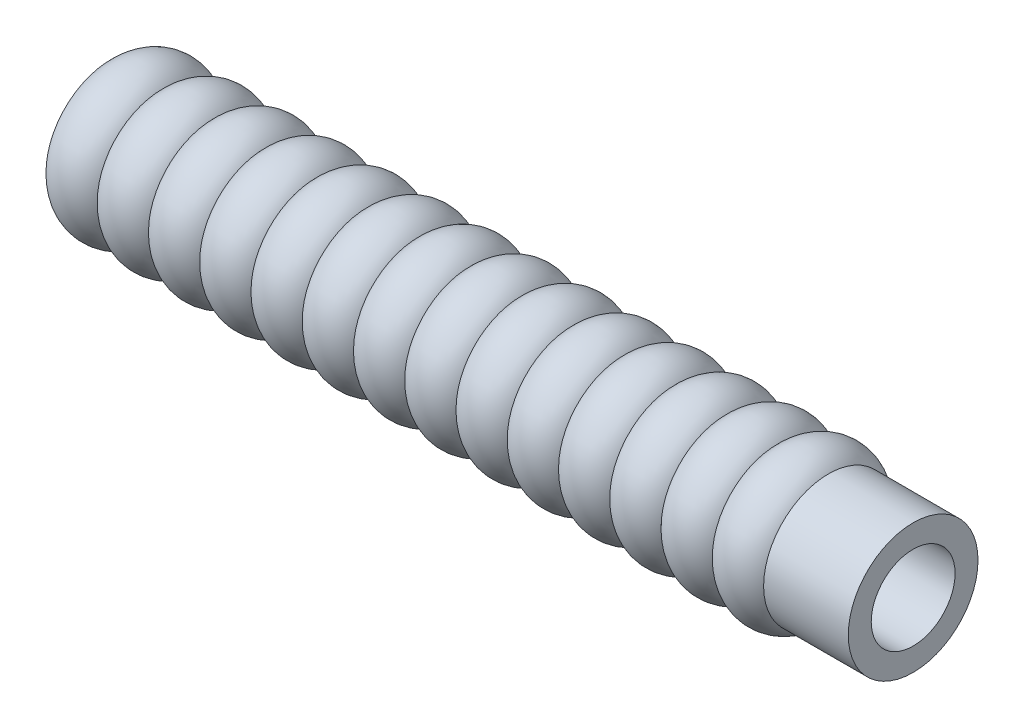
from build123d import *


with BuildPart() as part:
    # Sketch2 → Revolve2 (revolve)
    with BuildSketch(Plane.XY, mode=Mode.PRIVATE) as revolve2_sk:
        with BuildLine():
            Line((0, 0.6), (50, 3.658131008))
            Line((50, 3.658131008), (50, 5.658131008))
            Line((50, 5.658131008), (1.870676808, 2.714415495))
            ThreePointArc((1.870676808, 2.714415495), (0.497428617, 2.0446376), (0, 0.6))
        make_face()
    revolve(revolve2_sk.sketch.rotate(Axis((-19.275847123, 0, 0), (1, 0, 0)), 90), axis=Axis((-19.275847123, 0, 0), (1, 0, 0)))

    # Sketch4 → Revolve3 (revolve)
    with BuildSketch(Plane.XY, mode=Mode.PRIVATE) as revolve3_sk:
        with BuildLine():
            Line((112.60990337, 5.658131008), (120, 5.658131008))
            Line((120, 5.658131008), (120, 3.658131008))
            Line((120, 3.658131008), (112.60990337, 3.658131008))
            ThreePointArc((112.60990337, 3.658131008), (110.373835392, 2.658131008), (108.137767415, 3.658131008))
            ThreePointArc((108.137767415, 3.658131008), (105.901699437, 2.658131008), (103.66563146, 3.658131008))
            ThreePointArc((103.66563146, 3.658131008), (101.429563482, 2.658131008), (99.193495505, 3.658131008))
            ThreePointArc((99.193495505, 3.658131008), (96.957427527, 2.658131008), (94.72135955, 3.658131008))
            ThreePointArc((94.72135955, 3.658131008), (92.485291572, 2.658131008), (90.249223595, 3.658131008))
            ThreePointArc((90.249223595, 3.658131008), (88.013155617, 2.658131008), (85.77708764, 3.658131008))
            ThreePointArc((85.77708764, 3.658131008), (83.541019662, 2.658131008), (81.304951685, 3.658131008))
            ThreePointArc((81.304951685, 3.658131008), (79.068883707, 2.658131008), (76.83281573, 3.658131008))
            ThreePointArc((76.83281573, 3.658131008), (74.596747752, 2.658131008), (72.360679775, 3.658131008))
            ThreePointArc((72.360679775, 3.658131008), (70.124611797, 2.658131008), (67.88854382, 3.658131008))
            ThreePointArc((67.88854382, 3.658131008), (65.652475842, 2.658131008), (63.416407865, 3.658131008))
            ThreePointArc((63.416407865, 3.658131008), (61.180339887, 2.658131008), (58.94427191, 3.658131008))
            ThreePointArc((58.94427191, 3.658131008), (56.708203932, 2.658131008), (54.472135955, 3.658131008))
            ThreePointArc((54.472135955, 3.658131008), (52.236067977, 2.658131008), (50, 3.658131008))
            Line((50, 3.658131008), (50, 5.658131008))
            ThreePointArc((50, 5.658131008), (52.236067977, 6.658131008), (54.472135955, 5.658131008))
            ThreePointArc((54.472135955, 5.658131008), (56.708203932, 6.658131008), (58.94427191, 5.658131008))
            ThreePointArc((58.94427191, 5.658131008), (61.180339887, 6.658131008), (63.416407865, 5.658131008))
            ThreePointArc((63.416407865, 5.658131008), (65.652475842, 6.658131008), (67.88854382, 5.658131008))
            ThreePointArc((67.88854382, 5.658131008), (70.124611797, 6.658131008), (72.360679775, 5.658131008))
            ThreePointArc((72.360679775, 5.658131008), (74.596747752, 6.658131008), (76.83281573, 5.658131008))
            ThreePointArc((76.83281573, 5.658131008), (79.068883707, 6.658131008), (81.304951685, 5.658131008))
            ThreePointArc((81.304951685, 5.658131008), (83.541019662, 6.658131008), (85.77708764, 5.658131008))
            ThreePointArc((85.77708764, 5.658131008), (88.013155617, 6.658131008), (90.249223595, 5.658131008))
            ThreePointArc((90.249223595, 5.658131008), (92.485291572, 6.658131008), (94.72135955, 5.658131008))
            ThreePointArc((94.72135955, 5.658131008), (96.957427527, 6.658131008), (99.193495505, 5.658131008))
            ThreePointArc((99.193495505, 5.658131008), (101.429563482, 6.658131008), (103.66563146, 5.658131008))
            ThreePointArc((103.66563146, 5.658131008), (105.901699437, 6.658131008), (108.137767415, 5.658131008))
            ThreePointArc((108.137767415, 5.658131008), (110.373835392, 6.658131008), (112.60990337, 5.658131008))
        make_face()
    revolve(revolve3_sk.sketch.rotate(Axis((21.024758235, 0, 0), (1, 0, 0)), 90), axis=Axis((21.024758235, 0, 0), (1, 0, 0)))

    # Sketch5 → Revolve4 (revolve)
    with BuildSketch(Plane.XY, mode=Mode.PRIVATE) as revolve4_sk:
        Polygon((120, 3.658131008), (120, 5.658131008), (166.535898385, 5.658131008), (170, 3.658131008), align=None)
    revolve(revolve4_sk.sketch.rotate(Axis((115.901619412, 0, 0), (1, 0, 0)), 90), axis=Axis((115.901619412, 0, 0), (1, 0, 0)))

    # SurfaceCut1
    split(bisect_by=Plane(origin=(50, 0, 0), x_dir=(0, 0, -1), z_dir=(1, 0, 0)), keep=Keep.TOP)

    # SurfaceCut2
    split(bisect_by=Plane(origin=(120, 0, 0), x_dir=(0, 0, -1), z_dir=(1, 0, 0)), keep=Keep.BOTTOM)


solid = part.part
